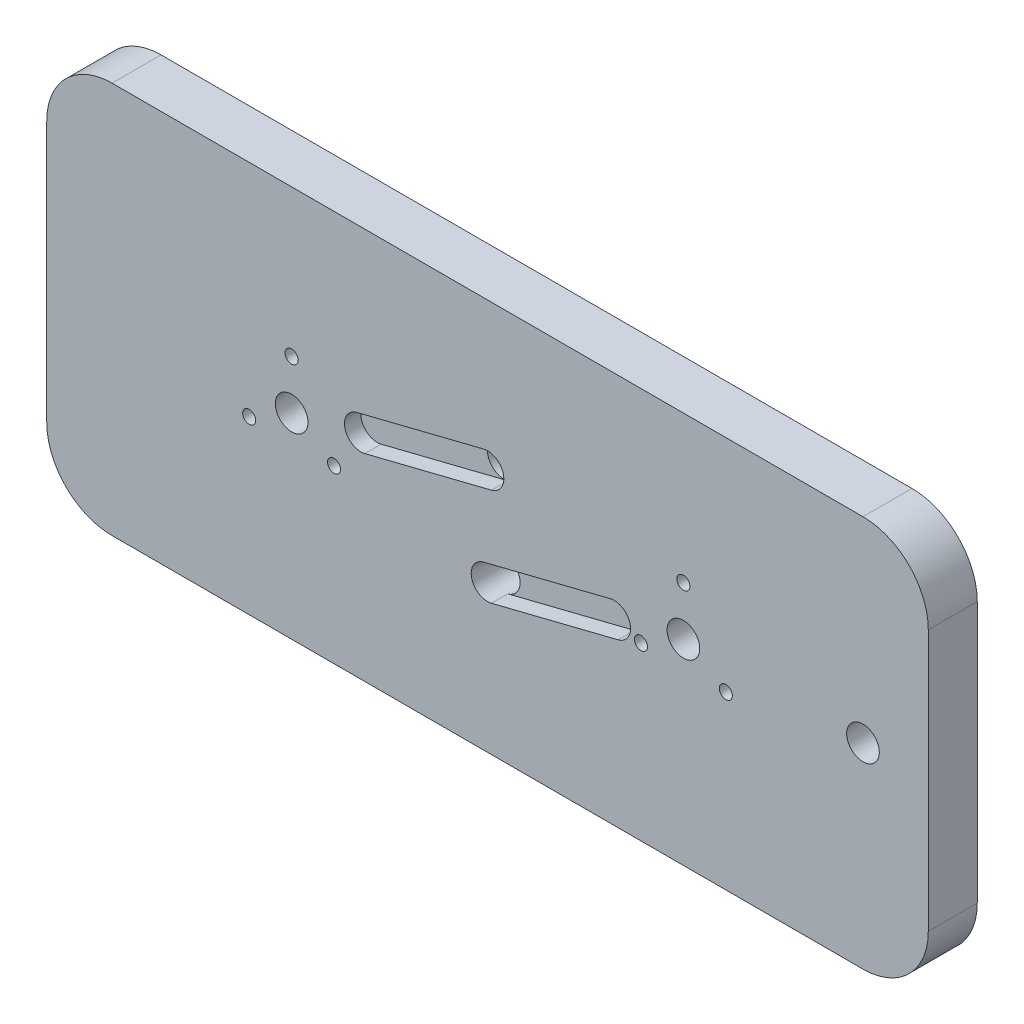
from build123d import *

# Parameters (mm, degrees)
ESQUISSE4_R             = 0.5
ESQUISSE4_R_2           = 0.2
BOSS_EXTRU_3_DEPTH      = 1.5
ENL_V_START             = -0.5
ENL_V_MAT_EXTRU_1_DEPTH = 0.5
ESQUISSE7_R             = 3.5
ESQUISSE7_R_2           = 3
BOSS_EXTRU_4_DEPTH      = 1


with BuildPart() as part:
    # Esquisse4 → Boss.-Extru.3 (new body)
    with BuildSketch(Plane.XY):
        with BuildLine():
            Line((-11.5, -6), (11.5, -6))
            ThreePointArc((11.5, -6), (12.914213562, -5.414213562), (13.5, -4))
            Line((13.5, -4), (13.5, 4))
            ThreePointArc((13.5, 4), (12.914213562, 5.414213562), (11.5, 6))
            Line((11.5, 6), (-11.5, 6))
            ThreePointArc((-11.5, 6), (-12.914213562, 5.414213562), (-13.5, 4))
            Line((-13.5, 4), (-13.5, -4))
            ThreePointArc((-13.5, -4), (-12.914213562, -5.414213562), (-11.5, -6))
        make_face()
        with Locations((0, 1.5)):
            Circle(ESQUISSE4_R, mode=Mode.SUBTRACT)
        with Locations((0, -1.5)):
            Circle(ESQUISSE4_R, mode=Mode.SUBTRACT)
        with Locations((-6, 1.5)):
            Circle(ESQUISSE4_R_2, mode=Mode.SUBTRACT)
        with Locations((-7.299038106, -0.75)):
            Circle(ESQUISSE4_R_2, mode=Mode.SUBTRACT)
        with Locations((-4.700961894, -0.75)):
            Circle(ESQUISSE4_R_2, mode=Mode.SUBTRACT)
        with Locations(Location((4.700961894, -0.75, 0), (0, 0, 180))):
            Circle(ESQUISSE4_R_2, mode=Mode.SUBTRACT)
        with Locations(Location((7.299038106, -0.75, 0), (0, 0, 180))):
            Circle(ESQUISSE4_R_2, mode=Mode.SUBTRACT)
        with Locations(Location((6, 1.5, 0), (0, 0, 180))):
            Circle(ESQUISSE4_R_2, mode=Mode.SUBTRACT)
        with Locations((6, 0)):
            Circle(ESQUISSE4_R, mode=Mode.SUBTRACT)
        with Locations((-6, 0)):
            Circle(ESQUISSE4_R, mode=Mode.SUBTRACT)
        with Locations((11.5, 0)):
            Circle(ESQUISSE4_R, mode=Mode.SUBTRACT)
    extrude(amount=BOSS_EXTRU_3_DEPTH)

    # Esquisse6 → Enl_v. mat.-Extru.1 (cut)
    with BuildSketch(Plane.XY.offset(1.5).offset(ENL_V_START)):
        with BuildLine():
            Line((0.121267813, 1.01492875), (-3.759302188, 0.04478625))
            ThreePointArc((-3.759302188, 0.04478625), (-4.365641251, 0.408589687), (-4.001837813, 1.01492875))
            Line((-4.001837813, 1.01492875), (-0.121267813, 1.98507125))
            ThreePointArc((-0.121267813, 1.98507125), (0.48507125, 1.621267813), (0.121267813, 1.01492875))
        make_face()
        with BuildLine():
            Line((-0.121267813, -1.01492875), (3.759302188, -0.04478625))
            ThreePointArc((3.759302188, -0.04478625), (4.365641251, -0.408589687), (4.001837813, -1.01492875))
            Line((4.001837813, -1.01492875), (0.121267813, -1.98507125))
            ThreePointArc((0.121267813, -1.98507125), (-0.48507125, -1.621267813), (-0.121267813, -1.01492875))
        make_face()
    extrude(amount=ENL_V_MAT_EXTRU_1_DEPTH, mode=Mode.SUBTRACT)

    # Esquisse7 → Boss.-Extru.4 (add)
    with BuildSketch(Plane(origin=(0, 0, 0), x_dir=(-1, 0, 0), z_dir=(0, 0, -1))):
        Circle(ESQUISSE7_R)
        Circle(ESQUISSE7_R_2, mode=Mode.SUBTRACT)
    extrude(amount=BOSS_EXTRU_4_DEPTH)


solid = part.part
